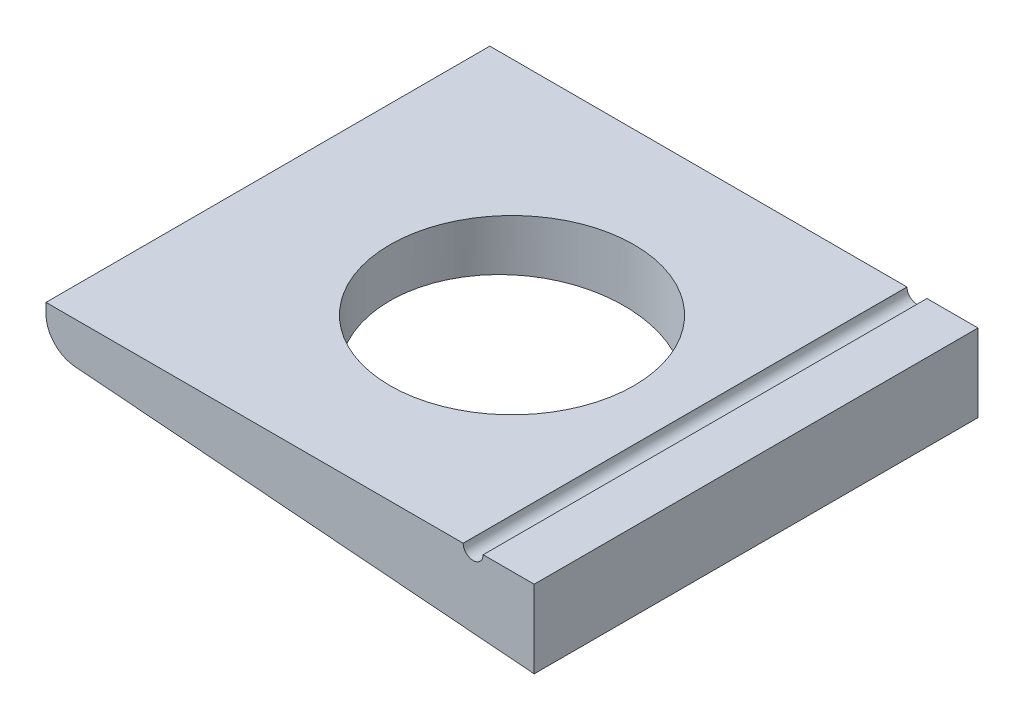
from build123d import *

# Parameters (mm, degrees)
BASE_EXTRUDE_DEPTH = 20
SKETCH2_R          = 11
CUT_EXTRUDE1_DEPTH = 31.545048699
SKETCH3_R          = 0.9
ID_GROOVES_DEPTH   = 47.184412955


with BuildPart() as part:
    # Sketch1 → Base-Extrude (new, symmetric)
    with BuildSketch(Plane.XY):
        with BuildLine():
            Line((22, 0), (-22, 0))
            Line((-22, 0), (-22, -0.91388277))
            ThreePointArc((-22, -0.91388277), (-21.256899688, -2.813662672), (-19.422025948, -3.705066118))
            Line((-19.422025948, -3.705066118), (22, -7))
            Line((22, -7), (22, 0))
        make_face()
    extrude(amount=BASE_EXTRUDE_DEPTH, both=True)

    # Sketch2 → Cut-Extrude1 (cut, through all)
    with BuildSketch(Plane(origin=(0, 0, 0), x_dir=(-1, 0, 0), z_dir=(0, 1, 0))):
        Circle(SKETCH2_R)
    extrude(amount=-CUT_EXTRUDE1_DEPTH, mode=Mode.SUBTRACT)

    # Sketch3 → ID-Grooves (cut, through all)
    with BuildSketch(Plane.XY.offset(20)):
        with Locations((16.5, 0)):
            Circle(SKETCH3_R)
    extrude(amount=-ID_GROOVES_DEPTH, mode=Mode.SUBTRACT)


solid = part.part
